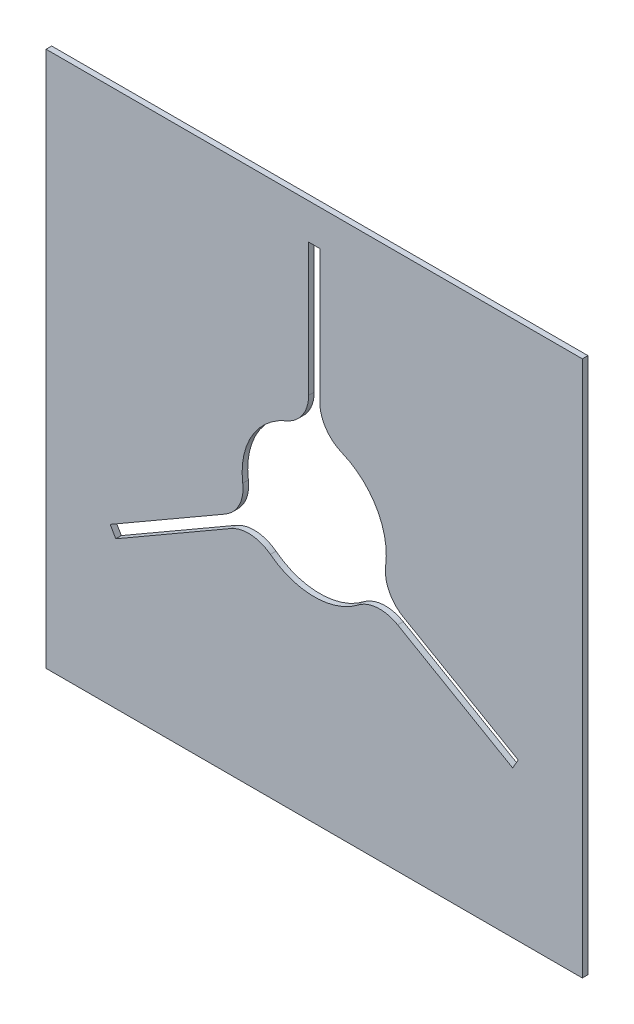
from build123d import *

# Parameters (mm, degrees)
SKETCH1_W                = 152.4
SKETCH1_H                = 152.4
BOSS_EXTRUDE1_DEPTH      = 1.5875
SKETCH3_R                = 20.4851
CUT_EXTRUDE2_DEPTH       = 108.77476586
SKETCH4_W                = 3.175
SKETCH4_H                = 66.04
CUT_EXTRUDE3_DEPTH       = 108.77476586
FILLET1_R                = 10.16
CIRPATTERN2_COUNT        = 3
FILLET1_OF_CIRPATTERN2_R = 10.16


with BuildPart() as part:
    # Sketch1 → Boss-Extrude1 (new body)
    with BuildSketch(Plane.XY):
        Rectangle(SKETCH1_W, SKETCH1_H)
    extrude(amount=BOSS_EXTRUDE1_DEPTH)

    # Sketch3 → Cut-Extrude2 (cut, through all)
    with BuildSketch(Plane.XY.offset(1.5875)):
        Circle(SKETCH3_R)
    extrude(amount=-CUT_EXTRUDE2_DEPTH, mode=Mode.SUBTRACT)

    # Sketch4 → Cut-Extrude3 (cut, through all)
    with BuildSketch(Plane.XY.offset(1.5875)):
        with Locations((0, 33.02)):
            Rectangle(SKETCH4_W, SKETCH4_H)
    cut_extrude3 = extrude(amount=-CUT_EXTRUDE3_DEPTH, mode=Mode.SUBTRACT)

    # Fillet1
    fillet1_edges = [part.edges().sort_by_distance(p)[0] for p in [
        (-1.5875, 20.423495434, 0.79375),
        (1.5875, 20.423495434, 0.79375),
    ]]
    fillet(fillet1_edges, radius=FILLET1_R)

    # CirPattern2: Cut-Extrude3 ×3 about axis
    cirpattern2_axis = Axis((0, 0, 0), (0, 0, 1))
    for i in range(1, CIRPATTERN2_COUNT):
        add(cut_extrude3.rotate(cirpattern2_axis, i * 360 / CIRPATTERN2_COUNT), mode=Mode.SUBTRACT)

    # Fillet1 of CirPattern2
    fillet1_of_cirpattern2_edges = [part.edges().sort_by_distance(p)[0] for p in [
        (-16.89351588, -11.586563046, 0.79375),
        (-18.48101588, -8.836932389, 0.79375),
        (18.48101588, -8.836932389, 0.79375),
        (16.89351588, -11.586563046, 0.79375),
    ]]
    fillet(fillet1_of_cirpattern2_edges, radius=FILLET1_OF_CIRPATTERN2_R)


solid = part.part
